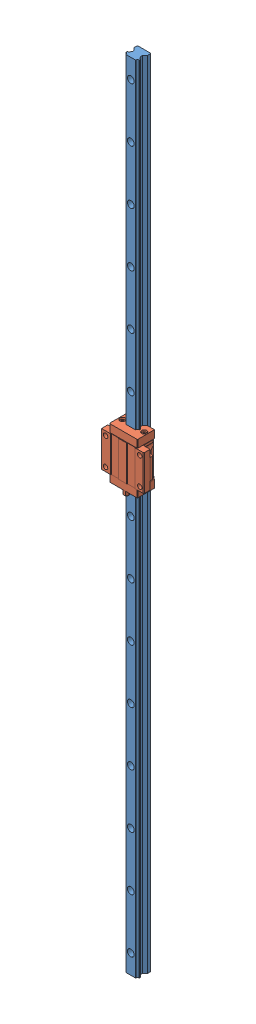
SolidWorks assembly MSA 15E + R883-21.5.SLDASM, configuration Default (file format 4700). Lengths in mm.
Overall size (47 883 24).
2 component instances, 2 part files, 2 mates.
Components (placement in the parent):
- MSA 15 R883-21.5-1: MSA 15 R883-21.5.SLDPRT [Default] at (-30.496 539.0421 31.0559) size (15 883 14.93)
- MSA15 Carriage-1: MSA15 Carriage.SLDPRT [Default] at (-30.496 75.1353 31.0559) size (47 63.45 19.8)
Mates (geometry in assembly coordinates):
- Coincident1: coincident anti-aligned: plane of MSA 15 R883-21.5-1 through (-25.325 -439.408 22.136) normal (0 0 1); plane of MSA15 Carriage-1 through (-35.9504 31.5352 22.136) normal (0 0 -1)
- Coincident2: coincident anti-aligned: plane of MSA 15 R883-21.5-1 through (-25.766 -439.408 14.077) normal (1 0 0); plane of MSA15 Carriage-1 through (-25.766 31.5352 16.035) normal (-1 0 0)
